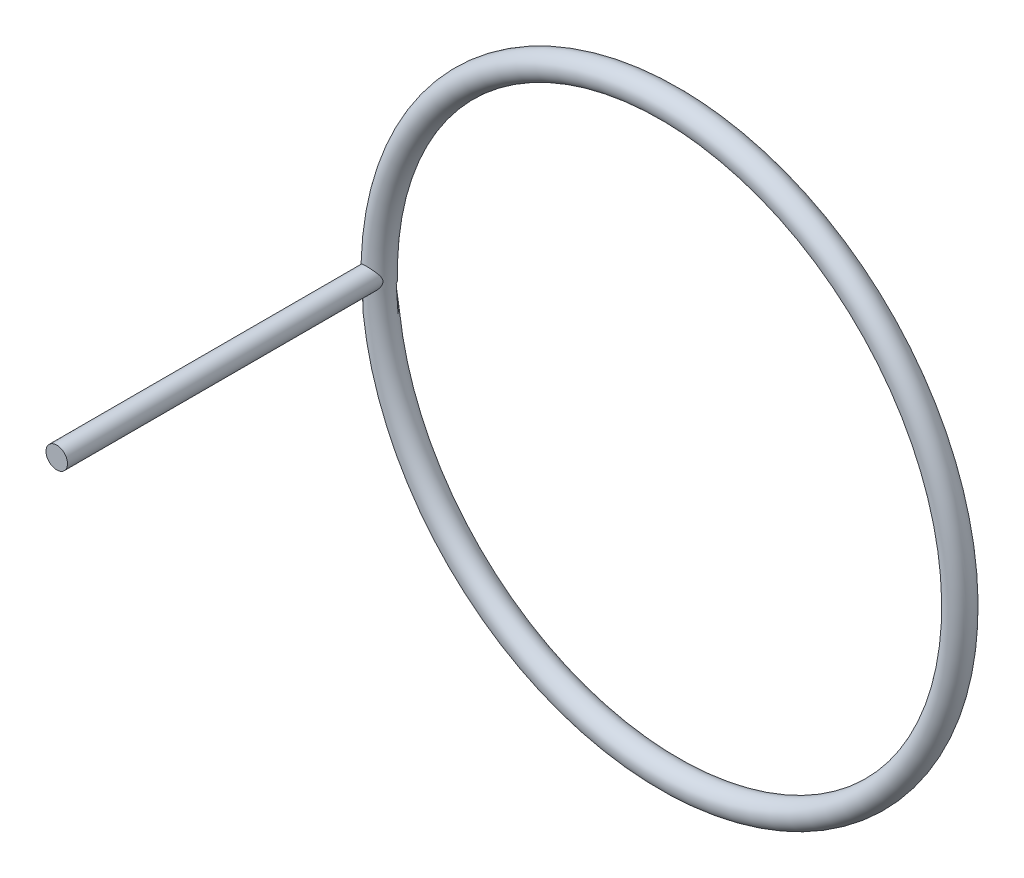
from build123d import *
from build123d.topology import SkipClean

# Parameters (mm, degrees)
SKETCH1_R      = 6.08
SKETCH1_R_2    = 5.08
SKETCH2_R      = 5.08
EXTRUDE1_DEPTH = 152.4


with BuildPart() as part:
    # Sketch1 → Revolve-Thin1 (revolve)
    with BuildSketch(Plane(origin=(0, 0, 0), x_dir=(1, 0, 0), z_dir=(0, 1, 0)), mode=Mode.PRIVATE) as revolve_thin1_sk:
        Circle(SKETCH1_R)
        Circle(SKETCH1_R_2, mode=Mode.SUBTRACT)
    revolve(revolve_thin1_sk.sketch.rotate(Axis((137.16, 0, 0), (0, 0, -1)), 180), axis=Axis((137.16, 0, 0), (0, 0, -1)))

    # Sketch2 → Extrude1 (add)
    with SkipClean():  # the faces are left unmerged after this step: merging them gives an invalid solid
        with BuildSketch(Plane.XY):
            with Locations(Location((0, 0, 0), (0, 0, 183.975929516))):
                Circle(SKETCH2_R)
        extrude(amount=EXTRUDE1_DEPTH)


solid = part.part
